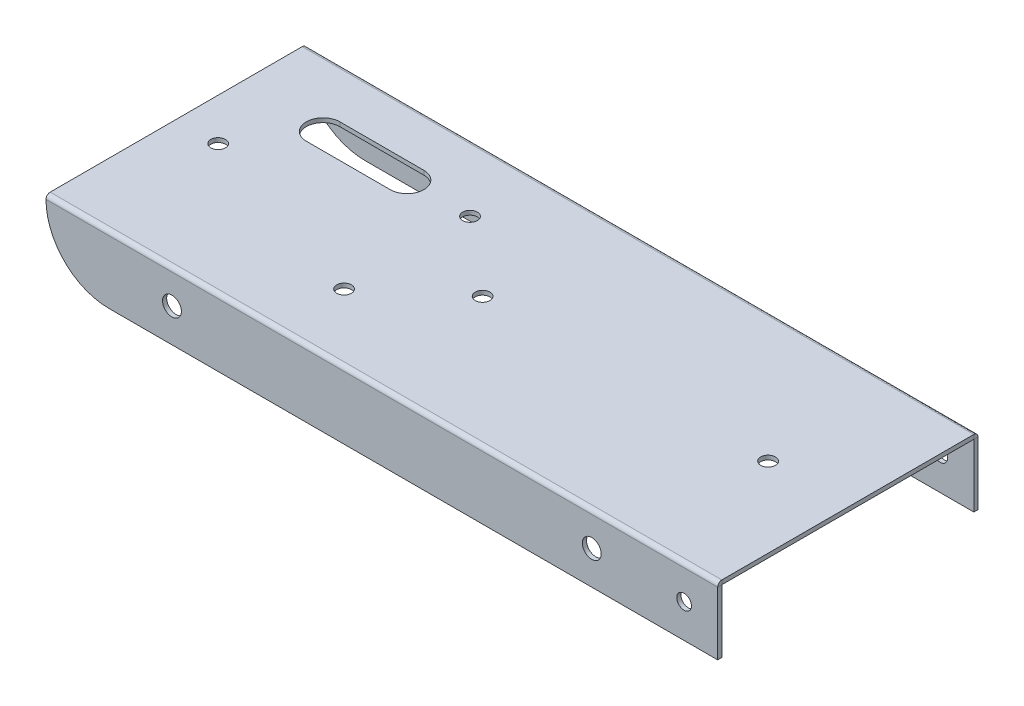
ISO-10303-21;
HEADER;
FILE_DESCRIPTION(('STEP AP214'),'2;1');
FILE_NAME('part.step','',(''),(''),'','','');
FILE_SCHEMA(('AUTOMOTIVE_DESIGN { 1 0 10303 214 1 1 1 1 }'));
ENDSEC;
DATA;
#1=APPLICATION_CONTEXT('core data for automotive mechanical design processes');
#2=APPLICATION_PROTOCOL_DEFINITION('international standard','automotive_design',2000,#1);
#3=PRODUCT_CONTEXT('',#1,'mechanical');
#4=PRODUCT('Part','Part','',(#3));
#5=PRODUCT_RELATED_PRODUCT_CATEGORY('part','',(#4));
#6=PRODUCT_DEFINITION_FORMATION('','',#4);
#7=PRODUCT_DEFINITION_CONTEXT('part definition',#1,'design');
#8=PRODUCT_DEFINITION('design','',#6,#7);
#9=PRODUCT_DEFINITION_SHAPE('','',#8);
#10=(LENGTH_UNIT() NAMED_UNIT(*) SI_UNIT(.MILLI.,.METRE.));
#11=(NAMED_UNIT(*) PLANE_ANGLE_UNIT() SI_UNIT($,.RADIAN.));
#12=(NAMED_UNIT(*) SI_UNIT($,.STERADIAN.) SOLID_ANGLE_UNIT());
#13=UNCERTAINTY_MEASURE_WITH_UNIT(LENGTH_MEASURE(1.E-05),#10,'distance_accuracy_value','');
#14=(GEOMETRIC_REPRESENTATION_CONTEXT(3) GLOBAL_UNCERTAINTY_ASSIGNED_CONTEXT((#13)) GLOBAL_UNIT_ASSIGNED_CONTEXT((#10,
#11,#12)) REPRESENTATION_CONTEXT('',''));
#15=CARTESIAN_POINT('',(0.,0.,0.));
#16=DIRECTION('',(0.,0.,1.));
#17=DIRECTION('',(1.,0.,0.));
#18=AXIS2_PLACEMENT_3D('',#15,#16,#17);
#19=CARTESIAN_POINT('',(-145.,0.,-79.));
#20=DIRECTION('',(0.,-1.,0.));
#21=DIRECTION('',(0.,0.,-1.));
#22=AXIS2_PLACEMENT_3D('',#19,#20,#21);
#23=PLANE('',#22);
#24=CARTESIAN_POINT('',(-105.,0.,-32.));
#25=DIRECTION('',(0.,1.,0.));
#26=DIRECTION('',(0.,0.,1.));
#27=AXIS2_PLACEMENT_3D('',#24,#25,#26);
#28=CIRCLE('',#27,1.75);
#29=CARTESIAN_POINT('',(-105.,0.,-30.25));
#30=VERTEX_POINT('',#29);
#31=EDGE_CURVE('E263',#30,#30,#28,.T.);
#32=ORIENTED_EDGE('',*,*,#31,.T.);
#33=EDGE_LOOP('',(#32));
#34=FACE_BOUND('',#33,.T.);
#35=CARTESIAN_POINT('',(-87.,0.,-47.));
#36=DIRECTION('',(0.,1.,0.));
#37=DIRECTION('',(0.,0.,1.));
#38=AXIS2_PLACEMENT_3D('',#35,#36,#37);
#39=CIRCLE('',#38,1.75);
#40=CARTESIAN_POINT('',(-87.,0.,-45.25));
#41=VERTEX_POINT('',#40);
#42=EDGE_CURVE('E275',#41,#41,#39,.T.);
#43=ORIENTED_EDGE('',*,*,#42,.T.);
#44=EDGE_LOOP('',(#43));
#45=FACE_BOUND('',#44,.T.);
#46=DIRECTION('',(-1.,0.,0.));
#47=VECTOR('',#46,1.);
#48=CARTESIAN_POINT('',(-140.,0.,-66.));
#49=LINE('',#48,#47);
#50=CARTESIAN_POINT('',(-120.,0.,-66.));
#51=VERTEX_POINT('',#50);
#52=CARTESIAN_POINT('',(-140.,0.,-66.));
#53=VERTEX_POINT('',#52);
#54=EDGE_CURVE('E296',#51,#53,#49,.T.);
#55=ORIENTED_EDGE('',*,*,#54,.T.);
#56=CARTESIAN_POINT('',(-140.,0.,-62.));
#57=DIRECTION('',(0.,1.,0.));
#58=DIRECTION('',(0.,0.,1.));
#59=AXIS2_PLACEMENT_3D('',#56,#57,#58);
#60=CIRCLE('',#59,4.);
#61=CARTESIAN_POINT('',(-140.,0.,-58.));
#62=VERTEX_POINT('',#61);
#63=EDGE_CURVE('E287',#53,#62,#60,.T.);
#64=ORIENTED_EDGE('',*,*,#63,.T.);
#65=DIRECTION('',(1.,0.,0.));
#66=VECTOR('',#65,1.);
#67=CARTESIAN_POINT('',(-120.,0.,-58.));
#68=LINE('',#67,#66);
#69=CARTESIAN_POINT('',(-120.,0.,-58.));
#70=VERTEX_POINT('',#69);
#71=EDGE_CURVE('E290',#62,#70,#68,.T.);
#72=ORIENTED_EDGE('',*,*,#71,.T.);
#73=CARTESIAN_POINT('',(-120.,0.,-62.));
#74=DIRECTION('',(0.,1.,0.));
#75=DIRECTION('',(0.,0.,1.));
#76=AXIS2_PLACEMENT_3D('',#73,#74,#75);
#77=CIRCLE('',#76,4.);
#78=EDGE_CURVE('E293',#70,#51,#77,.T.);
#79=ORIENTED_EDGE('',*,*,#78,.T.);
#80=EDGE_LOOP('',(#55,#64,#72,#79));
#81=FACE_BOUND('',#80,.T.);
#82=CARTESIAN_POINT('',(-19.,0.,-47.));
#83=DIRECTION('',(0.,1.,0.));
#84=DIRECTION('',(0.,0.,1.));
#85=AXIS2_PLACEMENT_3D('',#82,#83,#84);
#86=CIRCLE('',#85,1.75);
#87=CARTESIAN_POINT('',(-19.,0.,-45.25));
#88=VERTEX_POINT('',#87);
#89=EDGE_CURVE('E281',#88,#88,#86,.T.);
#90=ORIENTED_EDGE('',*,*,#89,.T.);
#91=EDGE_LOOP('',(#90));
#92=FACE_BOUND('',#91,.T.);
#93=CARTESIAN_POINT('',(-105.,0.,-62.));
#94=DIRECTION('',(0.,1.,0.));
#95=DIRECTION('',(0.,0.,1.));
#96=AXIS2_PLACEMENT_3D('',#93,#94,#95);
#97=CIRCLE('',#96,1.75);
#98=CARTESIAN_POINT('',(-105.,0.,-60.25));
#99=VERTEX_POINT('',#98);
#100=EDGE_CURVE('E269',#99,#99,#97,.T.);
#101=ORIENTED_EDGE('',*,*,#100,.T.);
#102=EDGE_LOOP('',(#101));
#103=FACE_BOUND('',#102,.T.);
#104=CARTESIAN_POINT('',(-150.,0.,-47.));
#105=DIRECTION('',(0.,1.,0.));
#106=DIRECTION('',(0.,0.,1.));
#107=AXIS2_PLACEMENT_3D('',#104,#105,#106);
#108=CIRCLE('',#107,1.75000000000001);
#109=CARTESIAN_POINT('',(-150.,0.,-45.25));
#110=VERTEX_POINT('',#109);
#111=EDGE_CURVE('E257',#110,#110,#108,.T.);
#112=ORIENTED_EDGE('',*,*,#111,.T.);
#113=EDGE_LOOP('',(#112));
#114=FACE_BOUND('',#113,.T.);
#115=DIRECTION('',(0.,0.,-1.));
#116=VECTOR('',#115,1.);
#117=CARTESIAN_POINT('',(0.,0.,-94.));
#118=LINE('',#117,#116);
#119=CARTESIAN_POINT('',(0.,0.,-16.995));
#120=VERTEX_POINT('',#119);
#121=CARTESIAN_POINT('',(0.,0.,-77.005));
#122=VERTEX_POINT('',#121);
#123=EDGE_CURVE('E57',#120,#122,#118,.T.);
#124=ORIENTED_EDGE('',*,*,#123,.F.);
#125=DIRECTION('',(-1.,0.,0.));
#126=VECTOR('',#125,1.);
#127=CARTESIAN_POINT('',(-145.,0.,-16.995));
#128=LINE('',#127,#126);
#129=CARTESIAN_POINT('',(-160.,0.,-16.995));
#130=VERTEX_POINT('',#129);
#131=EDGE_CURVE('E49',#120,#130,#128,.T.);
#132=ORIENTED_EDGE('',*,*,#131,.T.);
#133=DIRECTION('',(0.,0.,1.));
#134=VECTOR('',#133,1.);
#135=CARTESIAN_POINT('',(-160.,0.,-78.9999999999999));
#136=LINE('',#135,#134);
#137=CARTESIAN_POINT('',(-160.,0.,-77.005));
#138=VERTEX_POINT('',#137);
#139=EDGE_CURVE('E318',#138,#130,#136,.T.);
#140=ORIENTED_EDGE('',*,*,#139,.F.);
#141=DIRECTION('',(-1.,0.,0.));
#142=VECTOR('',#141,1.);
#143=CARTESIAN_POINT('',(-145.,0.,-77.005));
#144=LINE('',#143,#142);
#145=EDGE_CURVE('E324',#122,#138,#144,.T.);
#146=ORIENTED_EDGE('',*,*,#145,.F.);
#147=EDGE_LOOP('',(#124,#132,#140,#146));
#148=FACE_BOUND('',#147,.T.);
#149=ADVANCED_FACE('F40',(#34,#45,#81,#92,#103,#114,#148),#23,.T.);
#150=CARTESIAN_POINT('',(0.,1.,-94.));
#151=DIRECTION('',(-1.,0.,0.));
#152=DIRECTION('',(0.,0.,1.));
#153=AXIS2_PLACEMENT_3D('',#150,#151,#152);
#154=PLANE('',#153);
#155=DIRECTION('',(0.,1.,0.));
#156=VECTOR('',#155,1.);
#157=CARTESIAN_POINT('',(0.,1.,-16.995));
#158=LINE('',#157,#156);
#159=CARTESIAN_POINT('',(0.,1.,-16.995));
#160=VERTEX_POINT('',#159);
#161=EDGE_CURVE('E12',#120,#160,#158,.T.);
#162=ORIENTED_EDGE('',*,*,#161,.F.);
#163=ORIENTED_EDGE('',*,*,#123,.T.);
#164=DIRECTION('',(0.,1.,0.));
#165=VECTOR('',#164,1.);
#166=CARTESIAN_POINT('',(0.,1.,-77.005));
#167=LINE('',#166,#165);
#168=CARTESIAN_POINT('',(0.,1.,-77.005));
#169=VERTEX_POINT('',#168);
#170=EDGE_CURVE('E321',#122,#169,#167,.T.);
#171=ORIENTED_EDGE('',*,*,#170,.T.);
#172=DIRECTION('',(0.,0.,-1.));
#173=VECTOR('',#172,1.);
#174=CARTESIAN_POINT('',(0.,1.,-94.));
#175=LINE('',#174,#173);
#176=EDGE_CURVE('E44',#160,#169,#175,.T.);
#177=ORIENTED_EDGE('',*,*,#176,.F.);
#178=EDGE_LOOP('',(#162,#163,#171,#177));
#179=FACE_BOUND('',#178,.T.);
#180=ADVANCED_FACE('F42',(#179),#154,.F.);
#181=CARTESIAN_POINT('',(-160.,1.,-78.9999999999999));
#182=DIRECTION('',(1.,0.,0.));
#183=DIRECTION('',(0.,0.,-1.));
#184=AXIS2_PLACEMENT_3D('',#181,#182,#183);
#185=PLANE('',#184);
#186=DIRECTION('',(0.,-1.,0.));
#187=VECTOR('',#186,1.);
#188=CARTESIAN_POINT('',(-160.,1.,-16.995));
#189=LINE('',#188,#187);
#190=CARTESIAN_POINT('',(-160.,1.,-16.995));
#191=VERTEX_POINT('',#190);
#192=EDGE_CURVE('E333',#191,#130,#189,.T.);
#193=ORIENTED_EDGE('',*,*,#192,.F.);
#194=DIRECTION('',(0.,0.,1.));
#195=VECTOR('',#194,1.);
#196=CARTESIAN_POINT('',(-160.,1.,-78.9999999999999));
#197=LINE('',#196,#195);
#198=CARTESIAN_POINT('',(-160.,1.,-77.005));
#199=VERTEX_POINT('',#198);
#200=EDGE_CURVE('E65',#199,#191,#197,.T.);
#201=ORIENTED_EDGE('',*,*,#200,.F.);
#202=DIRECTION('',(0.,-1.,0.));
#203=VECTOR('',#202,1.);
#204=CARTESIAN_POINT('',(-160.,1.,-77.005));
#205=LINE('',#204,#203);
#206=EDGE_CURVE('E327',#199,#138,#205,.T.);
#207=ORIENTED_EDGE('',*,*,#206,.T.);
#208=ORIENTED_EDGE('',*,*,#139,.T.);
#209=EDGE_LOOP('',(#193,#201,#207,#208));
#210=FACE_BOUND('',#209,.T.);
#211=ADVANCED_FACE('F358',(#210),#185,.F.);
#212=CARTESIAN_POINT('',(-145.,1.,-79.));
#213=DIRECTION('',(0.,-1.,0.));
#214=DIRECTION('',(0.,0.,-1.));
#215=AXIS2_PLACEMENT_3D('',#212,#213,#214);
#216=PLANE('',#215);
#217=DIRECTION('',(-1.,0.,0.));
#218=VECTOR('',#217,1.);
#219=CARTESIAN_POINT('',(-145.,1.,-16.995));
#220=LINE('',#219,#218);
#221=EDGE_CURVE('E330',#160,#191,#220,.T.);
#222=ORIENTED_EDGE('',*,*,#221,.F.);
#223=ORIENTED_EDGE('',*,*,#176,.T.);
#224=DIRECTION('',(-1.,0.,0.));
#225=VECTOR('',#224,1.);
#226=CARTESIAN_POINT('',(-145.,1.,-77.005));
#227=LINE('',#226,#225);
#228=EDGE_CURVE('E319',#169,#199,#227,.T.);
#229=ORIENTED_EDGE('',*,*,#228,.T.);
#230=ORIENTED_EDGE('',*,*,#200,.T.);
#231=EDGE_LOOP('',(#222,#223,#229,#230));
#232=FACE_BOUND('',#231,.T.);
#233=CARTESIAN_POINT('',(-150.,1.,-47.));
#234=DIRECTION('',(0.,1.,0.));
#235=DIRECTION('',(0.,0.,1.));
#236=AXIS2_PLACEMENT_3D('',#233,#234,#235);
#237=CIRCLE('',#236,1.75000000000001);
#238=CARTESIAN_POINT('',(-150.,1.,-45.25));
#239=VERTEX_POINT('',#238);
#240=EDGE_CURVE('E260',#239,#239,#237,.T.);
#241=ORIENTED_EDGE('',*,*,#240,.F.);
#242=EDGE_LOOP('',(#241));
#243=FACE_BOUND('',#242,.T.);
#244=CARTESIAN_POINT('',(-105.,1.,-62.));
#245=DIRECTION('',(0.,1.,0.));
#246=DIRECTION('',(0.,0.,1.));
#247=AXIS2_PLACEMENT_3D('',#244,#245,#246);
#248=CIRCLE('',#247,1.75);
#249=CARTESIAN_POINT('',(-105.,1.,-60.25));
#250=VERTEX_POINT('',#249);
#251=EDGE_CURVE('E272',#250,#250,#248,.T.);
#252=ORIENTED_EDGE('',*,*,#251,.F.);
#253=EDGE_LOOP('',(#252));
#254=FACE_BOUND('',#253,.T.);
#255=CARTESIAN_POINT('',(-19.,1.,-47.));
#256=DIRECTION('',(0.,1.,0.));
#257=DIRECTION('',(0.,0.,1.));
#258=AXIS2_PLACEMENT_3D('',#255,#256,#257);
#259=CIRCLE('',#258,1.75);
#260=CARTESIAN_POINT('',(-19.,1.,-45.25));
#261=VERTEX_POINT('',#260);
#262=EDGE_CURVE('E284',#261,#261,#259,.T.);
#263=ORIENTED_EDGE('',*,*,#262,.F.);
#264=EDGE_LOOP('',(#263));
#265=FACE_BOUND('',#264,.T.);
#266=CARTESIAN_POINT('',(-140.,1.,-62.));
#267=DIRECTION('',(0.,1.,0.));
#268=DIRECTION('',(0.,0.,1.));
#269=AXIS2_PLACEMENT_3D('',#266,#267,#268);
#270=CIRCLE('',#269,4.);
#271=CARTESIAN_POINT('',(-140.,1.,-66.));
#272=VERTEX_POINT('',#271);
#273=CARTESIAN_POINT('',(-140.,1.,-58.));
#274=VERTEX_POINT('',#273);
#275=EDGE_CURVE('E299',#272,#274,#270,.T.);
#276=ORIENTED_EDGE('',*,*,#275,.F.);
#277=DIRECTION('',(-1.,0.,0.));
#278=VECTOR('',#277,1.);
#279=CARTESIAN_POINT('',(-140.,1.,-66.));
#280=LINE('',#279,#278);
#281=CARTESIAN_POINT('',(-120.,1.,-66.));
#282=VERTEX_POINT('',#281);
#283=EDGE_CURVE('E306',#282,#272,#280,.T.);
#284=ORIENTED_EDGE('',*,*,#283,.F.);
#285=CARTESIAN_POINT('',(-120.,1.,-62.));
#286=DIRECTION('',(0.,1.,0.));
#287=DIRECTION('',(0.,0.,1.));
#288=AXIS2_PLACEMENT_3D('',#285,#286,#287);
#289=CIRCLE('',#288,4.);
#290=CARTESIAN_POINT('',(-120.,1.,-58.));
#291=VERTEX_POINT('',#290);
#292=EDGE_CURVE('E303',#291,#282,#289,.T.);
#293=ORIENTED_EDGE('',*,*,#292,.F.);
#294=DIRECTION('',(1.,0.,0.));
#295=VECTOR('',#294,1.);
#296=CARTESIAN_POINT('',(-120.,1.,-58.));
#297=LINE('',#296,#295);
#298=EDGE_CURVE('E301',#274,#291,#297,.T.);
#299=ORIENTED_EDGE('',*,*,#298,.F.);
#300=EDGE_LOOP('',(#276,#284,#293,#299));
#301=FACE_BOUND('',#300,.T.);
#302=CARTESIAN_POINT('',(-87.,1.,-47.));
#303=DIRECTION('',(0.,1.,0.));
#304=DIRECTION('',(0.,0.,1.));
#305=AXIS2_PLACEMENT_3D('',#302,#303,#304);
#306=CIRCLE('',#305,1.75);
#307=CARTESIAN_POINT('',(-87.,1.,-45.25));
#308=VERTEX_POINT('',#307);
#309=EDGE_CURVE('E278',#308,#308,#306,.T.);
#310=ORIENTED_EDGE('',*,*,#309,.F.);
#311=EDGE_LOOP('',(#310));
#312=FACE_BOUND('',#311,.T.);
#313=CARTESIAN_POINT('',(-105.,1.,-32.));
#314=DIRECTION('',(0.,1.,0.));
#315=DIRECTION('',(0.,0.,1.));
#316=AXIS2_PLACEMENT_3D('',#313,#314,#315);
#317=CIRCLE('',#316,1.75);
#318=CARTESIAN_POINT('',(-105.,1.,-30.25));
#319=VERTEX_POINT('',#318);
#320=EDGE_CURVE('E266',#319,#319,#317,.T.);
#321=ORIENTED_EDGE('',*,*,#320,.F.);
#322=EDGE_LOOP('',(#321));
#323=FACE_BOUND('',#322,.T.);
#324=ADVANCED_FACE('F339',(#232,#243,#254,#265,#301,#312,#323),#216,.F.);
#325=CARTESIAN_POINT('',(-140.,1.,-62.));
#326=DIRECTION('',(0.,-1.,0.));
#327=DIRECTION('',(0.,0.,-1.));
#328=AXIS2_PLACEMENT_3D('',#325,#326,#327);
#329=CYLINDRICAL_SURFACE('',#328,4.);
#330=ORIENTED_EDGE('',*,*,#63,.F.);
#331=DIRECTION('',(0.,-1.,0.));
#332=VECTOR('',#331,1.);
#333=CARTESIAN_POINT('',(-140.,1.,-66.));
#334=LINE('',#333,#332);
#335=EDGE_CURVE('E308',#272,#53,#334,.T.);
#336=ORIENTED_EDGE('',*,*,#335,.F.);
#337=ORIENTED_EDGE('',*,*,#275,.T.);
#338=DIRECTION('',(0.,-1.,0.));
#339=VECTOR('',#338,1.);
#340=CARTESIAN_POINT('',(-140.,1.,-58.));
#341=LINE('',#340,#339);
#342=EDGE_CURVE('E315',#274,#62,#341,.T.);
#343=ORIENTED_EDGE('',*,*,#342,.T.);
#344=EDGE_LOOP('',(#330,#336,#337,#343));
#345=FACE_BOUND('',#344,.T.);
#346=ADVANCED_FACE('F422',(#345),#329,.F.);
#347=CARTESIAN_POINT('',(-120.,1.,-58.));
#348=DIRECTION('',(0.,0.,-1.));
#349=DIRECTION('',(-1.,0.,0.));
#350=AXIS2_PLACEMENT_3D('',#347,#348,#349);
#351=PLANE('',#350);
#352=ORIENTED_EDGE('',*,*,#71,.F.);
#353=ORIENTED_EDGE('',*,*,#342,.F.);
#354=ORIENTED_EDGE('',*,*,#298,.T.);
#355=DIRECTION('',(0.,-1.,0.));
#356=VECTOR('',#355,1.);
#357=CARTESIAN_POINT('',(-120.,1.,-58.));
#358=LINE('',#357,#356);
#359=EDGE_CURVE('E313',#291,#70,#358,.T.);
#360=ORIENTED_EDGE('',*,*,#359,.T.);
#361=EDGE_LOOP('',(#352,#353,#354,#360));
#362=FACE_BOUND('',#361,.T.);
#363=ADVANCED_FACE('F425',(#362),#351,.T.);
#364=CARTESIAN_POINT('',(-120.,1.,-62.));
#365=DIRECTION('',(0.,-1.,0.));
#366=DIRECTION('',(0.,0.,-1.));
#367=AXIS2_PLACEMENT_3D('',#364,#365,#366);
#368=CYLINDRICAL_SURFACE('',#367,4.);
#369=ORIENTED_EDGE('',*,*,#78,.F.);
#370=ORIENTED_EDGE('',*,*,#359,.F.);
#371=ORIENTED_EDGE('',*,*,#292,.T.);
#372=DIRECTION('',(0.,-1.,0.));
#373=VECTOR('',#372,1.);
#374=CARTESIAN_POINT('',(-120.,1.,-66.));
#375=LINE('',#374,#373);
#376=EDGE_CURVE('E311',#282,#51,#375,.T.);
#377=ORIENTED_EDGE('',*,*,#376,.T.);
#378=EDGE_LOOP('',(#369,#370,#371,#377));
#379=FACE_BOUND('',#378,.T.);
#380=ADVANCED_FACE('F429',(#379),#368,.F.);
#381=CARTESIAN_POINT('',(-140.,1.,-66.));
#382=DIRECTION('',(0.,0.,1.));
#383=DIRECTION('',(1.,0.,0.));
#384=AXIS2_PLACEMENT_3D('',#381,#382,#383);
#385=PLANE('',#384);
#386=ORIENTED_EDGE('',*,*,#54,.F.);
#387=ORIENTED_EDGE('',*,*,#376,.F.);
#388=ORIENTED_EDGE('',*,*,#283,.T.);
#389=ORIENTED_EDGE('',*,*,#335,.T.);
#390=EDGE_LOOP('',(#386,#387,#388,#389));
#391=FACE_BOUND('',#390,.T.);
#392=ADVANCED_FACE('F433',(#391),#385,.T.);
#393=CARTESIAN_POINT('',(-19.,1.,-47.));
#394=DIRECTION('',(0.,-1.,0.));
#395=DIRECTION('',(0.,0.,-1.));
#396=AXIS2_PLACEMENT_3D('',#393,#394,#395);
#397=CYLINDRICAL_SURFACE('',#396,1.75);
#398=ORIENTED_EDGE('',*,*,#262,.T.);
#399=EDGE_LOOP('',(#398));
#400=FACE_BOUND('',#399,.T.);
#401=ORIENTED_EDGE('',*,*,#89,.F.);
#402=EDGE_LOOP('',(#401));
#403=FACE_BOUND('',#402,.T.);
#404=ADVANCED_FACE('F437',(#400,#403),#397,.F.);
#405=CARTESIAN_POINT('',(-87.,1.,-47.));
#406=DIRECTION('',(0.,-1.,0.));
#407=DIRECTION('',(0.,0.,-1.));
#408=AXIS2_PLACEMENT_3D('',#405,#406,#407);
#409=CYLINDRICAL_SURFACE('',#408,1.75);
#410=ORIENTED_EDGE('',*,*,#309,.T.);
#411=EDGE_LOOP('',(#410));
#412=FACE_BOUND('',#411,.T.);
#413=ORIENTED_EDGE('',*,*,#42,.F.);
#414=EDGE_LOOP('',(#413));
#415=FACE_BOUND('',#414,.T.);
#416=ADVANCED_FACE('F441',(#412,#415),#409,.F.);
#417=CARTESIAN_POINT('',(-105.,1.,-62.));
#418=DIRECTION('',(0.,-1.,0.));
#419=DIRECTION('',(0.,0.,-1.));
#420=AXIS2_PLACEMENT_3D('',#417,#418,#419);
#421=CYLINDRICAL_SURFACE('',#420,1.75);
#422=ORIENTED_EDGE('',*,*,#251,.T.);
#423=EDGE_LOOP('',(#422));
#424=FACE_BOUND('',#423,.T.);
#425=ORIENTED_EDGE('',*,*,#100,.F.);
#426=EDGE_LOOP('',(#425));
#427=FACE_BOUND('',#426,.T.);
#428=ADVANCED_FACE('F445',(#424,#427),#421,.F.);
#429=CARTESIAN_POINT('',(-105.,1.,-32.));
#430=DIRECTION('',(0.,-1.,0.));
#431=DIRECTION('',(0.,0.,-1.));
#432=AXIS2_PLACEMENT_3D('',#429,#430,#431);
#433=CYLINDRICAL_SURFACE('',#432,1.75);
#434=ORIENTED_EDGE('',*,*,#320,.T.);
#435=EDGE_LOOP('',(#434));
#436=FACE_BOUND('',#435,.T.);
#437=ORIENTED_EDGE('',*,*,#31,.F.);
#438=EDGE_LOOP('',(#437));
#439=FACE_BOUND('',#438,.T.);
#440=ADVANCED_FACE('F449',(#436,#439),#433,.F.);
#441=CARTESIAN_POINT('',(-150.,1.,-47.));
#442=DIRECTION('',(0.,-1.,0.));
#443=DIRECTION('',(0.,0.,-1.));
#444=AXIS2_PLACEMENT_3D('',#441,#442,#443);
#445=CYLINDRICAL_SURFACE('',#444,1.75000000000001);
#446=ORIENTED_EDGE('',*,*,#240,.T.);
#447=EDGE_LOOP('',(#446));
#448=FACE_BOUND('',#447,.T.);
#449=ORIENTED_EDGE('',*,*,#111,.F.);
#450=EDGE_LOOP('',(#449));
#451=FACE_BOUND('',#450,.T.);
#452=ADVANCED_FACE('F453',(#448,#451),#445,.F.);
#453=CARTESIAN_POINT('',(0.,0.,-77.005));
#454=DIRECTION('',(1.,0.,0.));
#455=DIRECTION('',(0.,0.,-1.));
#456=AXIS2_PLACEMENT_3D('',#453,#454,#455);
#457=CYLINDRICAL_SURFACE('',#456,1.);
#458=CARTESIAN_POINT('',(0.,0.,-77.005));
#459=DIRECTION('',(1.,0.,0.));
#460=DIRECTION('',(0.,0.,-1.));
#461=AXIS2_PLACEMENT_3D('',#458,#459,#460);
#462=CIRCLE('',#461,1.);
#463=CARTESIAN_POINT('',(0.,0.,-78.005));
#464=VERTEX_POINT('',#463);
#465=EDGE_CURVE('E255',#464,#169,#462,.T.);
#466=ORIENTED_EDGE('',*,*,#465,.F.);
#467=DIRECTION('',(-1.,0.,0.));
#468=VECTOR('',#467,1.);
#469=CARTESIAN_POINT('',(-145.,0.,-78.005));
#470=LINE('',#469,#468);
#471=CARTESIAN_POINT('',(-160.,0.,-78.005));
#472=VERTEX_POINT('',#471);
#473=EDGE_CURVE('E199',#464,#472,#470,.T.);
#474=ORIENTED_EDGE('',*,*,#473,.T.);
#475=CARTESIAN_POINT('',(-160.,0.,-77.005));
#476=DIRECTION('',(1.,0.,0.));
#477=DIRECTION('',(0.,0.,-1.));
#478=AXIS2_PLACEMENT_3D('',#475,#476,#477);
#479=CIRCLE('',#478,1.);
#480=EDGE_CURVE('E202',#472,#199,#479,.T.);
#481=ORIENTED_EDGE('',*,*,#480,.T.);
#482=ORIENTED_EDGE('',*,*,#228,.F.);
#483=EDGE_LOOP('',(#466,#474,#481,#482));
#484=FACE_BOUND('',#483,.T.);
#485=ADVANCED_FACE('F349',(#484),#457,.T.);
#486=CARTESIAN_POINT('',(0.,0.,-78.005));
#487=DIRECTION('',(1.,0.,0.));
#488=DIRECTION('',(0.,0.,-1.));
#489=AXIS2_PLACEMENT_3D('',#486,#487,#488);
#490=PLANE('',#489);
#491=ORIENTED_EDGE('',*,*,#170,.F.);
#492=DIRECTION('',(0.,0.,-1.));
#493=VECTOR('',#492,1.);
#494=CARTESIAN_POINT('',(0.,0.,-78.005));
#495=LINE('',#494,#493);
#496=EDGE_CURVE('E246',#122,#464,#495,.T.);
#497=ORIENTED_EDGE('',*,*,#496,.T.);
#498=ORIENTED_EDGE('',*,*,#465,.T.);
#499=EDGE_LOOP('',(#491,#497,#498));
#500=FACE_BOUND('',#499,.T.);
#501=ADVANCED_FACE('F345',(#500),#490,.T.);
#502=CARTESIAN_POINT('',(-160.,0.,-78.005));
#503=DIRECTION('',(-1.,0.,0.));
#504=DIRECTION('',(0.,0.,1.));
#505=AXIS2_PLACEMENT_3D('',#502,#503,#504);
#506=PLANE('',#505);
#507=DIRECTION('',(0.,0.,1.));
#508=VECTOR('',#507,1.);
#509=CARTESIAN_POINT('',(-160.,0.,-78.005));
#510=LINE('',#509,#508);
#511=EDGE_CURVE('E249',#472,#138,#510,.T.);
#512=ORIENTED_EDGE('',*,*,#511,.T.);
#513=ORIENTED_EDGE('',*,*,#206,.F.);
#514=ORIENTED_EDGE('',*,*,#480,.F.);
#515=EDGE_LOOP('',(#512,#513,#514));
#516=FACE_BOUND('',#515,.T.);
#517=ADVANCED_FACE('F354',(#516),#506,.T.);
#518=CARTESIAN_POINT('',(-8.,-7.00499999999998,-78.005));
#519=DIRECTION('',(0.,0.,1.));
#520=DIRECTION('',(0.,-1.,0.));
#521=AXIS2_PLACEMENT_3D('',#518,#519,#520);
#522=CYLINDRICAL_SURFACE('',#521,1.75);
#523=CARTESIAN_POINT('',(-8.,-7.00499999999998,-78.005));
#524=DIRECTION('',(0.,0.,-1.));
#525=DIRECTION('',(0.,1.,0.));
#526=AXIS2_PLACEMENT_3D('',#523,#524,#525);
#527=CIRCLE('',#526,1.75);
#528=CARTESIAN_POINT('',(-8.,-5.25499999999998,-78.005));
#529=VERTEX_POINT('',#528);
#530=EDGE_CURVE('E243',#529,#529,#527,.T.);
#531=ORIENTED_EDGE('',*,*,#530,.T.);
#532=EDGE_LOOP('',(#531));
#533=FACE_BOUND('',#532,.T.);
#534=CARTESIAN_POINT('',(-8.,-7.00499999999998,-77.005));
#535=DIRECTION('',(0.,0.,-1.));
#536=DIRECTION('',(0.,1.,0.));
#537=AXIS2_PLACEMENT_3D('',#534,#535,#536);
#538=CIRCLE('',#537,1.75);
#539=CARTESIAN_POINT('',(-8.,-5.25499999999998,-77.005));
#540=VERTEX_POINT('',#539);
#541=EDGE_CURVE('E206',#540,#540,#538,.T.);
#542=ORIENTED_EDGE('',*,*,#541,.F.);
#543=EDGE_LOOP('',(#542));
#544=FACE_BOUND('',#543,.T.);
#545=ADVANCED_FACE('F462',(#533,#544),#522,.F.);
#546=CARTESIAN_POINT('',(-30.,-7.00499999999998,-78.005));
#547=DIRECTION('',(0.,0.,1.));
#548=DIRECTION('',(0.,-1.,0.));
#549=AXIS2_PLACEMENT_3D('',#546,#547,#548);
#550=CYLINDRICAL_SURFACE('',#549,2.25);
#551=CARTESIAN_POINT('',(-30.,-7.00499999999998,-78.005));
#552=DIRECTION('',(0.,0.,-1.));
#553=DIRECTION('',(0.,1.,0.));
#554=AXIS2_PLACEMENT_3D('',#551,#552,#553);
#555=CIRCLE('',#554,2.25);
#556=CARTESIAN_POINT('',(-30.,-4.75499999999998,-78.005));
#557=VERTEX_POINT('',#556);
#558=EDGE_CURVE('E240',#557,#557,#555,.T.);
#559=ORIENTED_EDGE('',*,*,#558,.T.);
#560=EDGE_LOOP('',(#559));
#561=FACE_BOUND('',#560,.T.);
#562=CARTESIAN_POINT('',(-30.,-7.00499999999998,-77.005));
#563=DIRECTION('',(0.,0.,-1.));
#564=DIRECTION('',(0.,1.,0.));
#565=AXIS2_PLACEMENT_3D('',#562,#563,#564);
#566=CIRCLE('',#565,2.25);
#567=CARTESIAN_POINT('',(-30.,-4.75499999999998,-77.005));
#568=VERTEX_POINT('',#567);
#569=EDGE_CURVE('E209',#568,#568,#566,.T.);
#570=ORIENTED_EDGE('',*,*,#569,.F.);
#571=EDGE_LOOP('',(#570));
#572=FACE_BOUND('',#571,.T.);
#573=ADVANCED_FACE('F686',(#561,#572),#550,.F.);
#574=CARTESIAN_POINT('',(-130.,-7.005,-78.005));
#575=DIRECTION('',(0.,0.,1.));
#576=DIRECTION('',(0.,-1.,0.));
#577=AXIS2_PLACEMENT_3D('',#574,#575,#576);
#578=CYLINDRICAL_SURFACE('',#577,2.25000000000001);
#579=CARTESIAN_POINT('',(-130.,-7.005,-78.005));
#580=DIRECTION('',(0.,0.,-1.));
#581=DIRECTION('',(0.,1.,0.));
#582=AXIS2_PLACEMENT_3D('',#579,#580,#581);
#583=CIRCLE('',#582,2.25000000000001);
#584=CARTESIAN_POINT('',(-130.,-4.75499999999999,-78.005));
#585=VERTEX_POINT('',#584);
#586=EDGE_CURVE('E237',#585,#585,#583,.T.);
#587=ORIENTED_EDGE('',*,*,#586,.T.);
#588=EDGE_LOOP('',(#587));
#589=FACE_BOUND('',#588,.T.);
#590=CARTESIAN_POINT('',(-130.,-7.005,-77.005));
#591=DIRECTION('',(0.,0.,-1.));
#592=DIRECTION('',(0.,1.,0.));
#593=AXIS2_PLACEMENT_3D('',#590,#591,#592);
#594=CIRCLE('',#593,2.25000000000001);
#595=CARTESIAN_POINT('',(-130.,-4.75499999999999,-77.005));
#596=VERTEX_POINT('',#595);
#597=EDGE_CURVE('E212',#596,#596,#594,.T.);
#598=ORIENTED_EDGE('',*,*,#597,.F.);
#599=EDGE_LOOP('',(#598));
#600=FACE_BOUND('',#599,.T.);
#601=ADVANCED_FACE('F409',(#589,#600),#578,.F.);
#602=CARTESIAN_POINT('',(-145.,-0.005000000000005,-78.005));
#603=DIRECTION('',(0.,0.,1.));
#604=DIRECTION('',(0.,-1.,0.));
#605=AXIS2_PLACEMENT_3D('',#602,#603,#604);
#606=CYLINDRICAL_SURFACE('',#605,15.);
#607=CARTESIAN_POINT('',(-145.,-0.005000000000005,-77.005));
#608=DIRECTION('',(0.,0.,-1.));
#609=DIRECTION('',(0.,-1.,0.));
#610=AXIS2_PLACEMENT_3D('',#607,#608,#609);
#611=CIRCLE('',#610,15.);
#612=CARTESIAN_POINT('',(-145.,-15.005,-77.0049999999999));
#613=VERTEX_POINT('',#612);
#614=CARTESIAN_POINT('',(-160.,-0.00499999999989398,-77.005));
#615=VERTEX_POINT('',#614);
#616=EDGE_CURVE('E235',#613,#615,#611,.T.);
#617=ORIENTED_EDGE('',*,*,#616,.T.);
#618=DIRECTION('',(0.,0.,1.));
#619=VECTOR('',#618,1.);
#620=CARTESIAN_POINT('',(-160.,-0.00499999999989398,-78.005));
#621=LINE('',#620,#619);
#622=CARTESIAN_POINT('',(-160.,-0.00499999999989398,-78.005));
#623=VERTEX_POINT('',#622);
#624=EDGE_CURVE('E203',#623,#615,#621,.T.);
#625=ORIENTED_EDGE('',*,*,#624,.F.);
#626=CARTESIAN_POINT('',(-145.,-0.005000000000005,-78.005));
#627=DIRECTION('',(0.,0.,-1.));
#628=DIRECTION('',(0.,-1.,0.));
#629=AXIS2_PLACEMENT_3D('',#626,#627,#628);
#630=CIRCLE('',#629,15.);
#631=CARTESIAN_POINT('',(-145.,-15.005,-78.0049999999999));
#632=VERTEX_POINT('',#631);
#633=EDGE_CURVE('E219',#632,#623,#630,.T.);
#634=ORIENTED_EDGE('',*,*,#633,.F.);
#635=DIRECTION('',(0.,0.,1.));
#636=VECTOR('',#635,1.);
#637=CARTESIAN_POINT('',(-145.,-15.005,-78.0049999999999));
#638=LINE('',#637,#636);
#639=EDGE_CURVE('E232',#632,#613,#638,.T.);
#640=ORIENTED_EDGE('',*,*,#639,.T.);
#641=EDGE_LOOP('',(#617,#625,#634,#640));
#642=FACE_BOUND('',#641,.T.);
#643=ADVANCED_FACE('F398',(#642),#606,.T.);
#644=CARTESIAN_POINT('',(0.,-15.005,-78.005));
#645=DIRECTION('',(0.,1.,0.));
#646=DIRECTION('',(1.,0.,0.));
#647=AXIS2_PLACEMENT_3D('',#644,#645,#646);
#648=PLANE('',#647);
#649=DIRECTION('',(-1.,0.,0.));
#650=VECTOR('',#649,1.);
#651=CARTESIAN_POINT('',(0.,-15.005,-77.005));
#652=LINE('',#651,#650);
#653=CARTESIAN_POINT('',(0.,-15.005,-77.005));
#654=VERTEX_POINT('',#653);
#655=EDGE_CURVE('E229',#654,#613,#652,.T.);
#656=ORIENTED_EDGE('',*,*,#655,.T.);
#657=ORIENTED_EDGE('',*,*,#639,.F.);
#658=DIRECTION('',(-1.,0.,0.));
#659=VECTOR('',#658,1.);
#660=CARTESIAN_POINT('',(0.,-15.005,-78.005));
#661=LINE('',#660,#659);
#662=CARTESIAN_POINT('',(0.,-15.005,-78.005));
#663=VERTEX_POINT('',#662);
#664=EDGE_CURVE('E221',#663,#632,#661,.T.);
#665=ORIENTED_EDGE('',*,*,#664,.F.);
#666=DIRECTION('',(0.,0.,1.));
#667=VECTOR('',#666,1.);
#668=CARTESIAN_POINT('',(0.,-15.005,-78.005));
#669=LINE('',#668,#667);
#670=EDGE_CURVE('E226',#663,#654,#669,.T.);
#671=ORIENTED_EDGE('',*,*,#670,.T.);
#672=EDGE_LOOP('',(#656,#657,#665,#671));
#673=FACE_BOUND('',#672,.T.);
#674=ADVANCED_FACE('F401',(#673),#648,.F.);
#675=CARTESIAN_POINT('',(-145.,-0.005000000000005,-78.005));
#676=DIRECTION('',(0.,0.,1.));
#677=DIRECTION('',(0.,-1.,0.));
#678=AXIS2_PLACEMENT_3D('',#675,#676,#677);
#679=PLANE('',#678);
#680=ORIENTED_EDGE('',*,*,#473,.F.);
#681=DIRECTION('',(0.,-1.,0.));
#682=VECTOR('',#681,1.);
#683=CARTESIAN_POINT('',(0.,-15.005,-78.005));
#684=LINE('',#683,#682);
#685=EDGE_CURVE('E224',#464,#663,#684,.T.);
#686=ORIENTED_EDGE('',*,*,#685,.T.);
#687=ORIENTED_EDGE('',*,*,#664,.T.);
#688=ORIENTED_EDGE('',*,*,#633,.T.);
#689=DIRECTION('',(0.,1.,0.));
#690=VECTOR('',#689,1.);
#691=CARTESIAN_POINT('',(-160.,-0.00499999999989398,-78.005));
#692=LINE('',#691,#690);
#693=EDGE_CURVE('E217',#623,#472,#692,.T.);
#694=ORIENTED_EDGE('',*,*,#693,.T.);
#695=EDGE_LOOP('',(#680,#686,#687,#688,#694));
#696=FACE_BOUND('',#695,.T.);
#697=ORIENTED_EDGE('',*,*,#586,.F.);
#698=EDGE_LOOP('',(#697));
#699=FACE_BOUND('',#698,.T.);
#700=ORIENTED_EDGE('',*,*,#558,.F.);
#701=EDGE_LOOP('',(#700));
#702=FACE_BOUND('',#701,.T.);
#703=ORIENTED_EDGE('',*,*,#530,.F.);
#704=EDGE_LOOP('',(#703));
#705=FACE_BOUND('',#704,.T.);
#706=ADVANCED_FACE('F391',(#696,#699,#702,#705),#679,.F.);
#707=CARTESIAN_POINT('',(0.,-15.005,-78.005));
#708=DIRECTION('',(-1.,0.,0.));
#709=DIRECTION('',(0.,1.,0.));
#710=AXIS2_PLACEMENT_3D('',#707,#708,#709);
#711=PLANE('',#710);
#712=ORIENTED_EDGE('',*,*,#496,.F.);
#713=DIRECTION('',(0.,-1.,0.));
#714=VECTOR('',#713,1.);
#715=CARTESIAN_POINT('',(0.,-15.005,-77.005));
#716=LINE('',#715,#714);
#717=EDGE_CURVE('E215',#122,#654,#716,.T.);
#718=ORIENTED_EDGE('',*,*,#717,.T.);
#719=ORIENTED_EDGE('',*,*,#670,.F.);
#720=ORIENTED_EDGE('',*,*,#685,.F.);
#721=EDGE_LOOP('',(#712,#718,#719,#720));
#722=FACE_BOUND('',#721,.T.);
#723=ADVANCED_FACE('F388',(#722),#711,.F.);
#724=CARTESIAN_POINT('',(-145.,-0.005000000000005,-77.005));
#725=DIRECTION('',(0.,0.,1.));
#726=DIRECTION('',(0.,-1.,0.));
#727=AXIS2_PLACEMENT_3D('',#724,#725,#726);
#728=PLANE('',#727);
#729=ORIENTED_EDGE('',*,*,#597,.T.);
#730=EDGE_LOOP('',(#729));
#731=FACE_BOUND('',#730,.T.);
#732=ORIENTED_EDGE('',*,*,#569,.T.);
#733=EDGE_LOOP('',(#732));
#734=FACE_BOUND('',#733,.T.);
#735=ORIENTED_EDGE('',*,*,#541,.T.);
#736=EDGE_LOOP('',(#735));
#737=FACE_BOUND('',#736,.T.);
#738=ORIENTED_EDGE('',*,*,#717,.F.);
#739=ORIENTED_EDGE('',*,*,#145,.T.);
#740=DIRECTION('',(0.,1.,0.));
#741=VECTOR('',#740,1.);
#742=CARTESIAN_POINT('',(-160.,-0.00499999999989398,-77.005));
#743=LINE('',#742,#741);
#744=EDGE_CURVE('E200',#615,#138,#743,.T.);
#745=ORIENTED_EDGE('',*,*,#744,.F.);
#746=ORIENTED_EDGE('',*,*,#616,.F.);
#747=ORIENTED_EDGE('',*,*,#655,.F.);
#748=EDGE_LOOP('',(#738,#739,#745,#746,#747));
#749=FACE_BOUND('',#748,.T.);
#750=ADVANCED_FACE('F384',(#731,#734,#737,#749),#728,.T.);
#751=CARTESIAN_POINT('',(-160.,-0.00499999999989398,-78.005));
#752=DIRECTION('',(1.,0.,0.));
#753=DIRECTION('',(0.,-1.,0.));
#754=AXIS2_PLACEMENT_3D('',#751,#752,#753);
#755=PLANE('',#754);
#756=ORIENTED_EDGE('',*,*,#511,.F.);
#757=ORIENTED_EDGE('',*,*,#693,.F.);
#758=ORIENTED_EDGE('',*,*,#624,.T.);
#759=ORIENTED_EDGE('',*,*,#744,.T.);
#760=EDGE_LOOP('',(#756,#757,#758,#759));
#761=FACE_BOUND('',#760,.T.);
#762=ADVANCED_FACE('F396',(#761),#755,.F.);
#763=CARTESIAN_POINT('',(-160.,0.,-16.995));
#764=DIRECTION('',(-1.,0.,0.));
#765=DIRECTION('',(0.,0.,1.));
#766=AXIS2_PLACEMENT_3D('',#763,#764,#765);
#767=CYLINDRICAL_SURFACE('',#766,1.);
#768=CARTESIAN_POINT('',(-160.,0.,-16.995));
#769=DIRECTION('',(-1.,0.,0.));
#770=DIRECTION('',(0.,0.,1.));
#771=AXIS2_PLACEMENT_3D('',#768,#769,#770);
#772=CIRCLE('',#771,1.);
#773=CARTESIAN_POINT('',(-160.,0.,-15.995));
#774=VERTEX_POINT('',#773);
#775=EDGE_CURVE('E195',#774,#191,#772,.T.);
#776=ORIENTED_EDGE('',*,*,#775,.F.);
#777=DIRECTION('',(-1.,0.,0.));
#778=VECTOR('',#777,1.);
#779=CARTESIAN_POINT('',(-145.,0.,-15.995));
#780=LINE('',#779,#778);
#781=CARTESIAN_POINT('',(0.,0.,-15.995));
#782=VERTEX_POINT('',#781);
#783=EDGE_CURVE('E365',#782,#774,#780,.T.);
#784=ORIENTED_EDGE('',*,*,#783,.F.);
#785=CARTESIAN_POINT('',(0.,0.,-16.995));
#786=DIRECTION('',(-1.,0.,0.));
#787=DIRECTION('',(0.,0.,1.));
#788=AXIS2_PLACEMENT_3D('',#785,#786,#787);
#789=CIRCLE('',#788,1.);
#790=EDGE_CURVE('E192',#782,#160,#789,.T.);
#791=ORIENTED_EDGE('',*,*,#790,.T.);
#792=ORIENTED_EDGE('',*,*,#221,.T.);
#793=EDGE_LOOP('',(#776,#784,#791,#792));
#794=FACE_BOUND('',#793,.T.);
#795=ADVANCED_FACE('F364',(#794),#767,.T.);
#796=CARTESIAN_POINT('',(-160.,0.,-15.995));
#797=DIRECTION('',(1.,0.,0.));
#798=DIRECTION('',(0.,0.,-1.));
#799=AXIS2_PLACEMENT_3D('',#796,#797,#798);
#800=PLANE('',#799);
#801=ORIENTED_EDGE('',*,*,#192,.T.);
#802=DIRECTION('',(0.,0.,-1.));
#803=VECTOR('',#802,1.);
#804=CARTESIAN_POINT('',(-160.,0.,-15.995));
#805=LINE('',#804,#803);
#806=EDGE_CURVE('E167',#774,#130,#805,.T.);
#807=ORIENTED_EDGE('',*,*,#806,.F.);
#808=ORIENTED_EDGE('',*,*,#775,.T.);
#809=EDGE_LOOP('',(#801,#807,#808));
#810=FACE_BOUND('',#809,.T.);
#811=ADVANCED_FACE('F360',(#810),#800,.F.);
#812=CARTESIAN_POINT('',(0.,0.,-15.995));
#813=DIRECTION('',(-1.,0.,0.));
#814=DIRECTION('',(0.,0.,1.));
#815=AXIS2_PLACEMENT_3D('',#812,#813,#814);
#816=PLANE('',#815);
#817=DIRECTION('',(0.,0.,1.));
#818=VECTOR('',#817,1.);
#819=CARTESIAN_POINT('',(0.,0.,-15.995));
#820=LINE('',#819,#818);
#821=EDGE_CURVE('E371',#120,#782,#820,.T.);
#822=ORIENTED_EDGE('',*,*,#821,.F.);
#823=ORIENTED_EDGE('',*,*,#161,.T.);
#824=ORIENTED_EDGE('',*,*,#790,.F.);
#825=EDGE_LOOP('',(#822,#823,#824));
#826=FACE_BOUND('',#825,.T.);
#827=ADVANCED_FACE('F369',(#826),#816,.F.);
#828=CARTESIAN_POINT('',(0.,-15.005,-15.9950000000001));
#829=DIRECTION('',(0.,1.,0.));
#830=DIRECTION('',(-1.,0.,0.));
#831=AXIS2_PLACEMENT_3D('',#828,#829,#830);
#832=PLANE('',#831);
#833=DIRECTION('',(1.,0.,0.));
#834=VECTOR('',#833,1.);
#835=CARTESIAN_POINT('',(0.,-15.005,-16.9950000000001));
#836=LINE('',#835,#834);
#837=CARTESIAN_POINT('',(-145.,-15.005,-16.9950000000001));
#838=VERTEX_POINT('',#837);
#839=CARTESIAN_POINT('',(0.,-15.005,-16.9950000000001));
#840=VERTEX_POINT('',#839);
#841=EDGE_CURVE('E185',#838,#840,#836,.T.);
#842=ORIENTED_EDGE('',*,*,#841,.T.);
#843=DIRECTION('',(0.,0.,-1.));
#844=VECTOR('',#843,1.);
#845=CARTESIAN_POINT('',(0.,-15.005,-15.9950000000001));
#846=LINE('',#845,#844);
#847=CARTESIAN_POINT('',(0.,-15.005,-15.9950000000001));
#848=VERTEX_POINT('',#847);
#849=EDGE_CURVE('E196',#848,#840,#846,.T.);
#850=ORIENTED_EDGE('',*,*,#849,.F.);
#851=DIRECTION('',(1.,0.,0.));
#852=VECTOR('',#851,1.);
#853=CARTESIAN_POINT('',(0.,-15.005,-15.9950000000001));
#854=LINE('',#853,#852);
#855=CARTESIAN_POINT('',(-145.,-15.005,-15.9950000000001));
#856=VERTEX_POINT('',#855);
#857=EDGE_CURVE('E833',#856,#848,#854,.T.);
#858=ORIENTED_EDGE('',*,*,#857,.F.);
#859=DIRECTION('',(0.,0.,-1.));
#860=VECTOR('',#859,1.);
#861=CARTESIAN_POINT('',(-145.,-15.005,-15.9950000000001));
#862=LINE('',#861,#860);
#863=EDGE_CURVE('E186',#856,#838,#862,.T.);
#864=ORIENTED_EDGE('',*,*,#863,.T.);
#865=EDGE_LOOP('',(#842,#850,#858,#864));
#866=FACE_BOUND('',#865,.T.);
#867=ADVANCED_FACE('F501',(#866),#832,.F.);
#868=CARTESIAN_POINT('',(-145.,-0.00500000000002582,-15.995));
#869=DIRECTION('',(0.,0.,-1.));
#870=DIRECTION('',(0.,1.,0.));
#871=AXIS2_PLACEMENT_3D('',#868,#869,#870);
#872=CYLINDRICAL_SURFACE('',#871,15.);
#873=CARTESIAN_POINT('',(-145.,-0.00500000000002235,-16.995));
#874=DIRECTION('',(0.,0.,1.));
#875=DIRECTION('',(0.,1.,0.));
#876=AXIS2_PLACEMENT_3D('',#873,#874,#875);
#877=CIRCLE('',#876,15.);
#878=CARTESIAN_POINT('',(-160.,-0.00499999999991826,-16.995));
#879=VERTEX_POINT('',#878);
#880=EDGE_CURVE('E176',#879,#838,#877,.T.);
#881=ORIENTED_EDGE('',*,*,#880,.T.);
#882=ORIENTED_EDGE('',*,*,#863,.F.);
#883=CARTESIAN_POINT('',(-145.,-0.00500000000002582,-15.995));
#884=DIRECTION('',(0.,0.,1.));
#885=DIRECTION('',(0.,1.,0.));
#886=AXIS2_PLACEMENT_3D('',#883,#884,#885);
#887=CIRCLE('',#886,15.);
#888=CARTESIAN_POINT('',(-160.,-0.00499999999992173,-15.995));
#889=VERTEX_POINT('',#888);
#890=EDGE_CURVE('E178',#889,#856,#887,.T.);
#891=ORIENTED_EDGE('',*,*,#890,.F.);
#892=DIRECTION('',(0.,0.,-1.));
#893=VECTOR('',#892,1.);
#894=CARTESIAN_POINT('',(-160.,-0.00499999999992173,-15.995));
#895=LINE('',#894,#893);
#896=EDGE_CURVE('E164',#889,#879,#895,.T.);
#897=ORIENTED_EDGE('',*,*,#896,.T.);
#898=EDGE_LOOP('',(#881,#882,#891,#897));
#899=FACE_BOUND('',#898,.T.);
#900=ADVANCED_FACE('F174',(#899),#872,.T.);
#901=CARTESIAN_POINT('',(-130.,-7.005,-15.995));
#902=DIRECTION('',(0.,0.,-1.));
#903=DIRECTION('',(0.,1.,0.));
#904=AXIS2_PLACEMENT_3D('',#901,#902,#903);
#905=CYLINDRICAL_SURFACE('',#904,2.25000000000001);
#906=CARTESIAN_POINT('',(-130.,-7.005,-15.995));
#907=DIRECTION('',(0.,0.,1.));
#908=DIRECTION('',(0.,-1.,0.));
#909=AXIS2_PLACEMENT_3D('',#906,#907,#908);
#910=CIRCLE('',#909,2.25000000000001);
#911=CARTESIAN_POINT('',(-130.,-9.25500000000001,-15.995));
#912=VERTEX_POINT('',#911);
#913=EDGE_CURVE('E179',#912,#912,#910,.T.);
#914=ORIENTED_EDGE('',*,*,#913,.T.);
#915=EDGE_LOOP('',(#914));
#916=FACE_BOUND('',#915,.T.);
#917=CARTESIAN_POINT('',(-130.,-7.005,-16.995));
#918=DIRECTION('',(0.,0.,1.));
#919=DIRECTION('',(0.,-1.,0.));
#920=AXIS2_PLACEMENT_3D('',#917,#918,#919);
#921=CIRCLE('',#920,2.25000000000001);
#922=CARTESIAN_POINT('',(-130.,-9.25500000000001,-16.995));
#923=VERTEX_POINT('',#922);
#924=EDGE_CURVE('E380',#923,#923,#921,.T.);
#925=ORIENTED_EDGE('',*,*,#924,.F.);
#926=EDGE_LOOP('',(#925));
#927=FACE_BOUND('',#926,.T.);
#928=ADVANCED_FACE('F515',(#916,#927),#905,.F.);
#929=CARTESIAN_POINT('',(-30.,-7.005,-15.995));
#930=DIRECTION('',(0.,0.,-1.));
#931=DIRECTION('',(0.,1.,0.));
#932=AXIS2_PLACEMENT_3D('',#929,#930,#931);
#933=CYLINDRICAL_SURFACE('',#932,2.25);
#934=CARTESIAN_POINT('',(-30.,-7.005,-15.995));
#935=DIRECTION('',(0.,0.,1.));
#936=DIRECTION('',(0.,-1.,0.));
#937=AXIS2_PLACEMENT_3D('',#934,#935,#936);
#938=CIRCLE('',#937,2.25);
#939=CARTESIAN_POINT('',(-30.,-9.255,-15.995));
#940=VERTEX_POINT('',#939);
#941=EDGE_CURVE('E827',#940,#940,#938,.T.);
#942=ORIENTED_EDGE('',*,*,#941,.T.);
#943=EDGE_LOOP('',(#942));
#944=FACE_BOUND('',#943,.T.);
#945=CARTESIAN_POINT('',(-30.,-7.005,-16.995));
#946=DIRECTION('',(0.,0.,1.));
#947=DIRECTION('',(0.,-1.,0.));
#948=AXIS2_PLACEMENT_3D('',#945,#946,#947);
#949=CIRCLE('',#948,2.25);
#950=CARTESIAN_POINT('',(-30.,-9.255,-16.995));
#951=VERTEX_POINT('',#950);
#952=EDGE_CURVE('E844',#951,#951,#949,.T.);
#953=ORIENTED_EDGE('',*,*,#952,.F.);
#954=EDGE_LOOP('',(#953));
#955=FACE_BOUND('',#954,.T.);
#956=ADVANCED_FACE('F522',(#944,#955),#933,.F.);
#957=CARTESIAN_POINT('',(-8.00000000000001,-7.005,-15.995));
#958=DIRECTION('',(0.,0.,-1.));
#959=DIRECTION('',(0.,1.,0.));
#960=AXIS2_PLACEMENT_3D('',#957,#958,#959);
#961=CYLINDRICAL_SURFACE('',#960,1.75);
#962=CARTESIAN_POINT('',(-8.00000000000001,-7.005,-15.995));
#963=DIRECTION('',(0.,0.,1.));
#964=DIRECTION('',(0.,-1.,0.));
#965=AXIS2_PLACEMENT_3D('',#962,#963,#964);
#966=CIRCLE('',#965,1.75);
#967=CARTESIAN_POINT('',(-8.00000000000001,-8.755,-15.995));
#968=VERTEX_POINT('',#967);
#969=EDGE_CURVE('E823',#968,#968,#966,.T.);
#970=ORIENTED_EDGE('',*,*,#969,.T.);
#971=EDGE_LOOP('',(#970));
#972=FACE_BOUND('',#971,.T.);
#973=CARTESIAN_POINT('',(-8.00000000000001,-7.005,-16.995));
#974=DIRECTION('',(0.,0.,1.));
#975=DIRECTION('',(0.,-1.,0.));
#976=AXIS2_PLACEMENT_3D('',#973,#974,#975);
#977=CIRCLE('',#976,1.75);
#978=CARTESIAN_POINT('',(-8.00000000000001,-8.755,-16.995));
#979=VERTEX_POINT('',#978);
#980=EDGE_CURVE('E171',#979,#979,#977,.T.);
#981=ORIENTED_EDGE('',*,*,#980,.F.);
#982=EDGE_LOOP('',(#981));
#983=FACE_BOUND('',#982,.T.);
#984=ADVANCED_FACE('F530',(#972,#983),#961,.F.);
#985=CARTESIAN_POINT('',(-145.,63.995,-15.9949999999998));
#986=DIRECTION('',(0.,0.,-1.));
#987=DIRECTION('',(0.,1.,0.));
#988=AXIS2_PLACEMENT_3D('',#985,#986,#987);
#989=PLANE('',#988);
#990=ORIENTED_EDGE('',*,*,#969,.F.);
#991=EDGE_LOOP('',(#990));
#992=FACE_BOUND('',#991,.T.);
#993=ORIENTED_EDGE('',*,*,#941,.F.);
#994=EDGE_LOOP('',(#993));
#995=FACE_BOUND('',#994,.T.);
#996=ORIENTED_EDGE('',*,*,#913,.F.);
#997=EDGE_LOOP('',(#996));
#998=FACE_BOUND('',#997,.T.);
#999=DIRECTION('',(0.,1.,0.));
#1000=VECTOR('',#999,1.);
#1001=CARTESIAN_POINT('',(0.,78.995,-15.9949999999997));
#1002=LINE('',#1001,#1000);
#1003=EDGE_CURVE('E831',#848,#782,#1002,.T.);
#1004=ORIENTED_EDGE('',*,*,#1003,.T.);
#1005=ORIENTED_EDGE('',*,*,#783,.T.);
#1006=DIRECTION('',(0.,-1.,0.));
#1007=VECTOR('',#1006,1.);
#1008=CARTESIAN_POINT('',(-160.,63.9949999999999,-15.9949999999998));
#1009=LINE('',#1008,#1007);
#1010=EDGE_CURVE('E835',#774,#889,#1009,.T.);
#1011=ORIENTED_EDGE('',*,*,#1010,.T.);
#1012=ORIENTED_EDGE('',*,*,#890,.T.);
#1013=ORIENTED_EDGE('',*,*,#857,.T.);
#1014=EDGE_LOOP('',(#1004,#1005,#1011,#1012,#1013));
#1015=FACE_BOUND('',#1014,.T.);
#1016=ADVANCED_FACE('F538',(#992,#995,#998,#1015),#989,.F.);
#1017=CARTESIAN_POINT('',(-160.,63.9949999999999,-15.9949999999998));
#1018=DIRECTION('',(1.,0.,0.));
#1019=DIRECTION('',(0.,1.,0.));
#1020=AXIS2_PLACEMENT_3D('',#1017,#1018,#1019);
#1021=PLANE('',#1020);
#1022=ORIENTED_EDGE('',*,*,#1010,.F.);
#1023=ORIENTED_EDGE('',*,*,#806,.T.);
#1024=DIRECTION('',(0.,-1.,0.));
#1025=VECTOR('',#1024,1.);
#1026=CARTESIAN_POINT('',(-160.,63.9949999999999,-16.9949999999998));
#1027=LINE('',#1026,#1025);
#1028=EDGE_CURVE('E160',#130,#879,#1027,.T.);
#1029=ORIENTED_EDGE('',*,*,#1028,.T.);
#1030=ORIENTED_EDGE('',*,*,#896,.F.);
#1031=EDGE_LOOP('',(#1022,#1023,#1029,#1030));
#1032=FACE_BOUND('',#1031,.T.);
#1033=ADVANCED_FACE('F163',(#1032),#1021,.F.);
#1034=CARTESIAN_POINT('',(-145.,63.995,-16.9949999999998));
#1035=DIRECTION('',(0.,0.,-1.));
#1036=DIRECTION('',(0.,1.,0.));
#1037=AXIS2_PLACEMENT_3D('',#1034,#1035,#1036);
#1038=PLANE('',#1037);
#1039=ORIENTED_EDGE('',*,*,#131,.F.);
#1040=DIRECTION('',(0.,1.,0.));
#1041=VECTOR('',#1040,1.);
#1042=CARTESIAN_POINT('',(0.,78.995,-16.9949999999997));
#1043=LINE('',#1042,#1041);
#1044=EDGE_CURVE('E375',#840,#120,#1043,.T.);
#1045=ORIENTED_EDGE('',*,*,#1044,.F.);
#1046=ORIENTED_EDGE('',*,*,#841,.F.);
#1047=ORIENTED_EDGE('',*,*,#880,.F.);
#1048=ORIENTED_EDGE('',*,*,#1028,.F.);
#1049=EDGE_LOOP('',(#1039,#1045,#1046,#1047,#1048));
#1050=FACE_BOUND('',#1049,.T.);
#1051=ORIENTED_EDGE('',*,*,#980,.T.);
#1052=EDGE_LOOP('',(#1051));
#1053=FACE_BOUND('',#1052,.T.);
#1054=ORIENTED_EDGE('',*,*,#952,.T.);
#1055=EDGE_LOOP('',(#1054));
#1056=FACE_BOUND('',#1055,.T.);
#1057=ORIENTED_EDGE('',*,*,#924,.T.);
#1058=EDGE_LOOP('',(#1057));
#1059=FACE_BOUND('',#1058,.T.);
#1060=ADVANCED_FACE('F182',(#1050,#1053,#1056,#1059),#1038,.T.);
#1061=CARTESIAN_POINT('',(0.,78.995,-15.9949999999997));
#1062=DIRECTION('',(-1.,0.,0.));
#1063=DIRECTION('',(0.,-1.,0.));
#1064=AXIS2_PLACEMENT_3D('',#1061,#1062,#1063);
#1065=PLANE('',#1064);
#1066=ORIENTED_EDGE('',*,*,#1044,.T.);
#1067=ORIENTED_EDGE('',*,*,#821,.T.);
#1068=ORIENTED_EDGE('',*,*,#1003,.F.);
#1069=ORIENTED_EDGE('',*,*,#849,.T.);
#1070=EDGE_LOOP('',(#1066,#1067,#1068,#1069));
#1071=FACE_BOUND('',#1070,.T.);
#1072=ADVANCED_FACE('F378',(#1071),#1065,.F.);
#1073=CLOSED_SHELL('',(#149,#180,#211,#324,#346,#363,#380,#392,#404,#416,#428,#440,#452,#485,
#501,#517,#545,#573,#601,#643,#674,#706,#723,#750,#762,#795,#811,#827,#867,#900,#928,#956,#984,
#1016,#1033,#1060,#1072));
#1074=MANIFOLD_SOLID_BREP('B2',#1073);
#1075=ADVANCED_BREP_SHAPE_REPRESENTATION('',(#18,#1074),#14);
#1076=SHAPE_DEFINITION_REPRESENTATION(#9,#1075);
ENDSEC;
END-ISO-10303-21;
